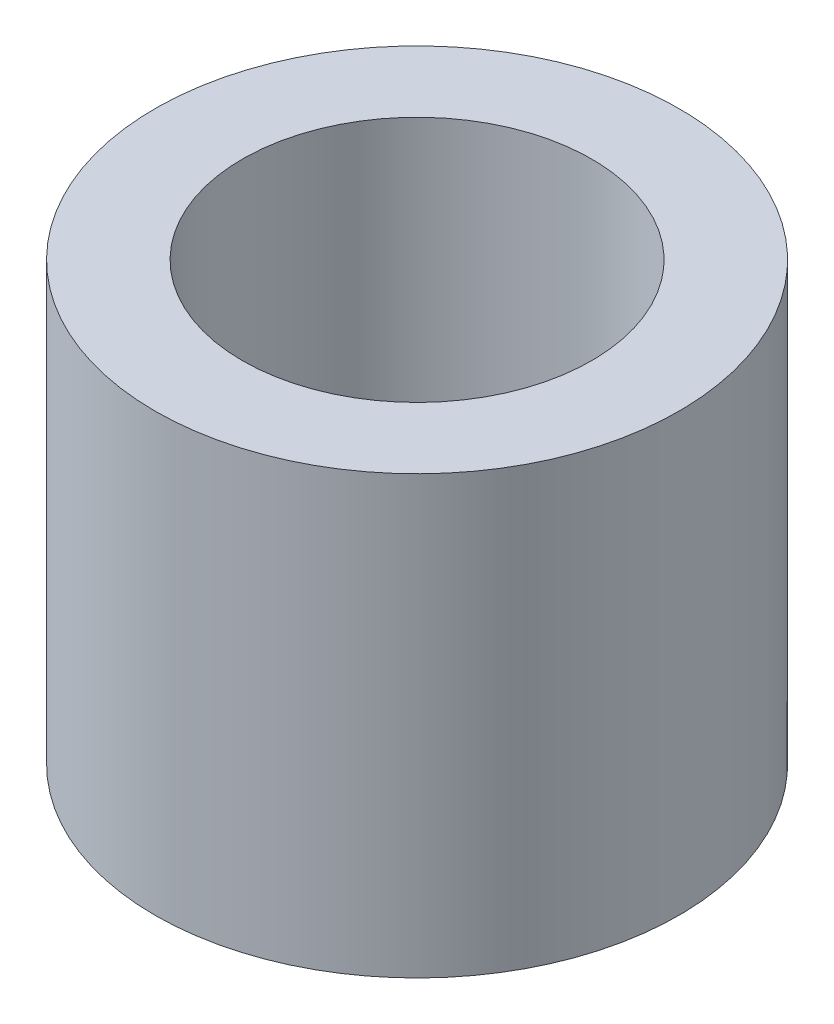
from build123d import *

# Parameters (mm, degrees)
ESQUISSE1_R      = 6
ESQUISSE1_R_2    = 4
EXTRUSION1_DEPTH = 10


with BuildPart() as part:
    # Esquisse1 → Extrusion1 (new body)
    with BuildSketch(Plane(origin=(0, 0, 0), x_dir=(1, 0, 0), z_dir=(0, 1, 0))):
        with Locations(Location((0, 0, 0), (0, 0, 270))):
            Circle(ESQUISSE1_R)
        with Locations(Location((0, 0, 0), (0, 0, 270))):
            Circle(ESQUISSE1_R_2, mode=Mode.SUBTRACT)
    extrude(amount=EXTRUSION1_DEPTH)


solid = part.part
